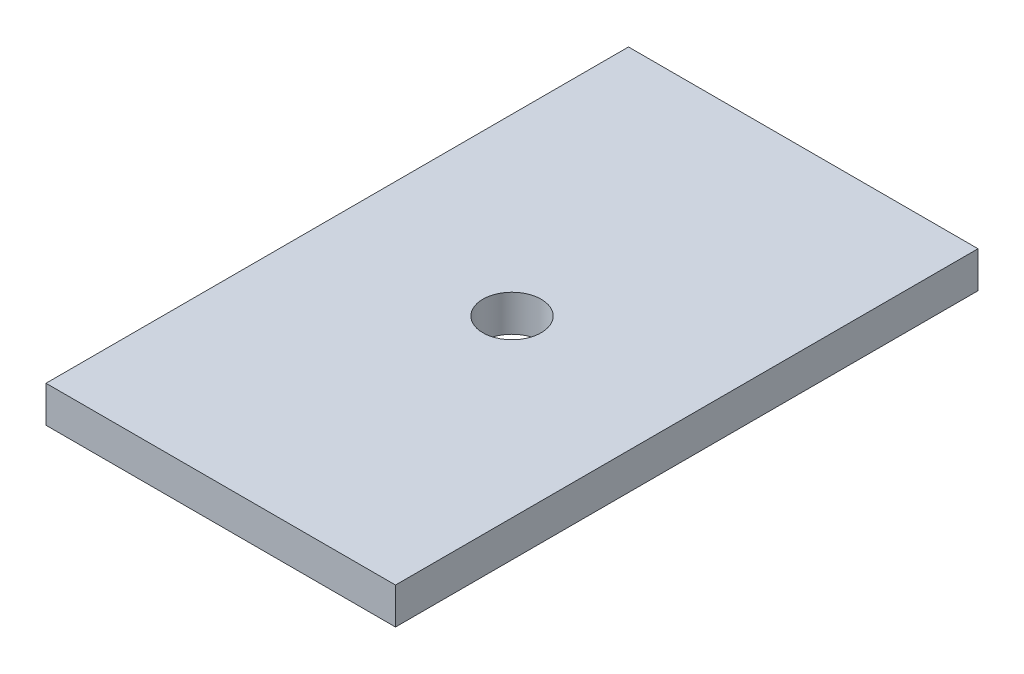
ISO-10303-21;
HEADER;
FILE_DESCRIPTION(('STEP AP214'),'2;1');
FILE_NAME('part.step','',(''),(''),'','','');
FILE_SCHEMA(('AUTOMOTIVE_DESIGN { 1 0 10303 214 1 1 1 1 }'));
ENDSEC;
DATA;
#1=APPLICATION_CONTEXT('core data for automotive mechanical design processes');
#2=APPLICATION_PROTOCOL_DEFINITION('international standard','automotive_design',2000,#1);
#3=PRODUCT_CONTEXT('',#1,'mechanical');
#4=PRODUCT('Part','Part','',(#3));
#5=PRODUCT_RELATED_PRODUCT_CATEGORY('part','',(#4));
#6=PRODUCT_DEFINITION_FORMATION('','',#4);
#7=PRODUCT_DEFINITION_CONTEXT('part definition',#1,'design');
#8=PRODUCT_DEFINITION('design','',#6,#7);
#9=PRODUCT_DEFINITION_SHAPE('','',#8);
#10=(LENGTH_UNIT() NAMED_UNIT(*) SI_UNIT(.MILLI.,.METRE.));
#11=(NAMED_UNIT(*) PLANE_ANGLE_UNIT() SI_UNIT($,.RADIAN.));
#12=(NAMED_UNIT(*) SI_UNIT($,.STERADIAN.) SOLID_ANGLE_UNIT());
#13=UNCERTAINTY_MEASURE_WITH_UNIT(LENGTH_MEASURE(1.E-05),#10,'distance_accuracy_value','');
#14=(GEOMETRIC_REPRESENTATION_CONTEXT(3) GLOBAL_UNCERTAINTY_ASSIGNED_CONTEXT((#13)) GLOBAL_UNIT_ASSIGNED_CONTEXT((#10,
#11,#12)) REPRESENTATION_CONTEXT('',''));
#15=CARTESIAN_POINT('',(0.,0.,0.));
#16=DIRECTION('',(0.,0.,1.));
#17=DIRECTION('',(1.,0.,0.));
#18=AXIS2_PLACEMENT_3D('',#15,#16,#17);
#19=CARTESIAN_POINT('',(152.4,31.75,0.));
#20=DIRECTION('',(1.,0.,0.));
#21=DIRECTION('',(0.,0.,-1.));
#22=AXIS2_PLACEMENT_3D('',#19,#20,#21);
#23=PLANE('',#22);
#24=DIRECTION('',(0.,0.,1.));
#25=VECTOR('',#24,1.);
#26=CARTESIAN_POINT('',(152.4,0.,0.));
#27=LINE('',#26,#25);
#28=CARTESIAN_POINT('',(152.4,0.,0.));
#29=VERTEX_POINT('',#28);
#30=CARTESIAN_POINT('',(152.4,0.,508.));
#31=VERTEX_POINT('',#30);
#32=EDGE_CURVE('E72',#29,#31,#27,.T.);
#33=ORIENTED_EDGE('',*,*,#32,.F.);
#34=DIRECTION('',(0.,-1.,0.));
#35=VECTOR('',#34,1.);
#36=CARTESIAN_POINT('',(152.4,31.75,0.));
#37=LINE('',#36,#35);
#38=CARTESIAN_POINT('',(152.4,31.75,0.));
#39=VERTEX_POINT('',#38);
#40=EDGE_CURVE('E11',#39,#29,#37,.T.);
#41=ORIENTED_EDGE('',*,*,#40,.F.);
#42=DIRECTION('',(0.,0.,1.));
#43=VECTOR('',#42,1.);
#44=CARTESIAN_POINT('',(152.4,31.75,0.));
#45=LINE('',#44,#43);
#46=CARTESIAN_POINT('',(152.4,31.75,508.));
#47=VERTEX_POINT('',#46);
#48=EDGE_CURVE('E73',#39,#47,#45,.T.);
#49=ORIENTED_EDGE('',*,*,#48,.T.);
#50=DIRECTION('',(0.,-1.,0.));
#51=VECTOR('',#50,1.);
#52=CARTESIAN_POINT('',(152.4,31.75,508.));
#53=LINE('',#52,#51);
#54=EDGE_CURVE('E33',#47,#31,#53,.T.);
#55=ORIENTED_EDGE('',*,*,#54,.T.);
#56=EDGE_LOOP('',(#33,#41,#49,#55));
#57=FACE_BOUND('',#56,.T.);
#58=ADVANCED_FACE('F30',(#57),#23,.T.);
#59=CARTESIAN_POINT('',(152.4,31.75,0.));
#60=DIRECTION('',(0.,0.,1.));
#61=DIRECTION('',(1.,0.,0.));
#62=AXIS2_PLACEMENT_3D('',#59,#60,#61);
#63=PLANE('',#62);
#64=DIRECTION('',(-1.,0.,0.));
#65=VECTOR('',#64,1.);
#66=CARTESIAN_POINT('',(152.4,0.,0.));
#67=LINE('',#66,#65);
#68=CARTESIAN_POINT('',(-152.4,0.,0.));
#69=VERTEX_POINT('',#68);
#70=EDGE_CURVE('E88',#29,#69,#67,.T.);
#71=ORIENTED_EDGE('',*,*,#70,.T.);
#72=DIRECTION('',(0.,-1.,0.));
#73=VECTOR('',#72,1.);
#74=CARTESIAN_POINT('',(-152.4,31.75,0.));
#75=LINE('',#74,#73);
#76=CARTESIAN_POINT('',(-152.4,31.75,0.));
#77=VERTEX_POINT('',#76);
#78=EDGE_CURVE('E38',#77,#69,#75,.T.);
#79=ORIENTED_EDGE('',*,*,#78,.F.);
#80=DIRECTION('',(-1.,0.,0.));
#81=VECTOR('',#80,1.);
#82=CARTESIAN_POINT('',(152.4,31.75,0.));
#83=LINE('',#82,#81);
#84=EDGE_CURVE('E51',#39,#77,#83,.T.);
#85=ORIENTED_EDGE('',*,*,#84,.F.);
#86=ORIENTED_EDGE('',*,*,#40,.T.);
#87=EDGE_LOOP('',(#71,#79,#85,#86));
#88=FACE_BOUND('',#87,.T.);
#89=ADVANCED_FACE('F108',(#88),#63,.F.);
#90=CARTESIAN_POINT('',(-152.4,31.75,508.));
#91=DIRECTION('',(-1.,0.,0.));
#92=DIRECTION('',(0.,0.,1.));
#93=AXIS2_PLACEMENT_3D('',#90,#91,#92);
#94=PLANE('',#93);
#95=DIRECTION('',(0.,0.,-1.));
#96=VECTOR('',#95,1.);
#97=CARTESIAN_POINT('',(-152.4,0.,508.));
#98=LINE('',#97,#96);
#99=CARTESIAN_POINT('',(-152.4,0.,508.));
#100=VERTEX_POINT('',#99);
#101=EDGE_CURVE('E83',#100,#69,#98,.T.);
#102=ORIENTED_EDGE('',*,*,#101,.F.);
#103=DIRECTION('',(0.,-1.,0.));
#104=VECTOR('',#103,1.);
#105=CARTESIAN_POINT('',(-152.4,31.75,508.));
#106=LINE('',#105,#104);
#107=CARTESIAN_POINT('',(-152.4,31.75,508.));
#108=VERTEX_POINT('',#107);
#109=EDGE_CURVE('E76',#108,#100,#106,.T.);
#110=ORIENTED_EDGE('',*,*,#109,.F.);
#111=DIRECTION('',(0.,0.,-1.));
#112=VECTOR('',#111,1.);
#113=CARTESIAN_POINT('',(-152.4,31.75,508.));
#114=LINE('',#113,#112);
#115=EDGE_CURVE('E101',#108,#77,#114,.T.);
#116=ORIENTED_EDGE('',*,*,#115,.T.);
#117=ORIENTED_EDGE('',*,*,#78,.T.);
#118=EDGE_LOOP('',(#102,#110,#116,#117));
#119=FACE_BOUND('',#118,.T.);
#120=ADVANCED_FACE('F106',(#119),#94,.T.);
#121=CARTESIAN_POINT('',(-152.4,31.75,508.));
#122=DIRECTION('',(0.,0.,-1.));
#123=DIRECTION('',(-1.,0.,0.));
#124=AXIS2_PLACEMENT_3D('',#121,#122,#123);
#125=PLANE('',#124);
#126=DIRECTION('',(1.,0.,0.));
#127=VECTOR('',#126,1.);
#128=CARTESIAN_POINT('',(-152.4,0.,508.));
#129=LINE('',#128,#127);
#130=EDGE_CURVE('E78',#100,#31,#129,.T.);
#131=ORIENTED_EDGE('',*,*,#130,.T.);
#132=ORIENTED_EDGE('',*,*,#54,.F.);
#133=DIRECTION('',(1.,0.,0.));
#134=VECTOR('',#133,1.);
#135=CARTESIAN_POINT('',(-152.4,31.75,508.));
#136=LINE('',#135,#134);
#137=EDGE_CURVE('E99',#108,#47,#136,.T.);
#138=ORIENTED_EDGE('',*,*,#137,.F.);
#139=ORIENTED_EDGE('',*,*,#109,.T.);
#140=EDGE_LOOP('',(#131,#132,#138,#139));
#141=FACE_BOUND('',#140,.T.);
#142=ADVANCED_FACE('F79',(#141),#125,.F.);
#143=CARTESIAN_POINT('',(152.4,31.75,0.));
#144=DIRECTION('',(0.,-1.,0.));
#145=DIRECTION('',(0.,0.,-1.));
#146=AXIS2_PLACEMENT_3D('',#143,#144,#145);
#147=PLANE('',#146);
#148=CARTESIAN_POINT('',(0.,31.75,254.));
#149=DIRECTION('',(0.,1.,0.));
#150=DIRECTION('',(0.,0.,1.));
#151=AXIS2_PLACEMENT_3D('',#148,#149,#150);
#152=CIRCLE('',#151,25.4);
#153=CARTESIAN_POINT('',(0.,31.75,279.4));
#154=VERTEX_POINT('',#153);
#155=EDGE_CURVE('E92',#154,#154,#152,.T.);
#156=ORIENTED_EDGE('',*,*,#155,.F.);
#157=EDGE_LOOP('',(#156));
#158=FACE_BOUND('',#157,.T.);
#159=ORIENTED_EDGE('',*,*,#48,.F.);
#160=ORIENTED_EDGE('',*,*,#84,.T.);
#161=ORIENTED_EDGE('',*,*,#115,.F.);
#162=ORIENTED_EDGE('',*,*,#137,.T.);
#163=EDGE_LOOP('',(#159,#160,#161,#162));
#164=FACE_BOUND('',#163,.T.);
#165=ADVANCED_FACE('F109',(#158,#164),#147,.F.);
#166=CARTESIAN_POINT('',(152.4,0.,0.));
#167=DIRECTION('',(0.,-1.,0.));
#168=DIRECTION('',(0.,0.,-1.));
#169=AXIS2_PLACEMENT_3D('',#166,#167,#168);
#170=PLANE('',#169);
#171=CARTESIAN_POINT('',(0.,0.,254.));
#172=DIRECTION('',(0.,1.,0.));
#173=DIRECTION('',(0.,0.,1.));
#174=AXIS2_PLACEMENT_3D('',#171,#172,#173);
#175=CIRCLE('',#174,25.4);
#176=CARTESIAN_POINT('',(0.,0.,279.4));
#177=VERTEX_POINT('',#176);
#178=EDGE_CURVE('E89',#177,#177,#175,.T.);
#179=ORIENTED_EDGE('',*,*,#178,.T.);
#180=EDGE_LOOP('',(#179));
#181=FACE_BOUND('',#180,.T.);
#182=ORIENTED_EDGE('',*,*,#32,.T.);
#183=ORIENTED_EDGE('',*,*,#130,.F.);
#184=ORIENTED_EDGE('',*,*,#101,.T.);
#185=ORIENTED_EDGE('',*,*,#70,.F.);
#186=EDGE_LOOP('',(#182,#183,#184,#185));
#187=FACE_BOUND('',#186,.T.);
#188=ADVANCED_FACE('F86',(#181,#187),#170,.T.);
#189=CARTESIAN_POINT('',(0.,0.,254.));
#190=DIRECTION('',(0.,1.,0.));
#191=DIRECTION('',(0.,0.,1.));
#192=AXIS2_PLACEMENT_3D('',#189,#190,#191);
#193=CYLINDRICAL_SURFACE('',#192,25.4);
#194=ORIENTED_EDGE('',*,*,#178,.F.);
#195=EDGE_LOOP('',(#194));
#196=FACE_BOUND('',#195,.T.);
#197=ORIENTED_EDGE('',*,*,#155,.T.);
#198=EDGE_LOOP('',(#197));
#199=FACE_BOUND('',#198,.T.);
#200=ADVANCED_FACE('F117',(#196,#199),#193,.F.);
#201=CLOSED_SHELL('',(#58,#89,#120,#142,#165,#188,#200));
#202=MANIFOLD_SOLID_BREP('B2',#201);
#203=ADVANCED_BREP_SHAPE_REPRESENTATION('',(#18,#202),#14);
#204=SHAPE_DEFINITION_REPRESENTATION(#9,#203);
ENDSEC;
END-ISO-10303-21;
